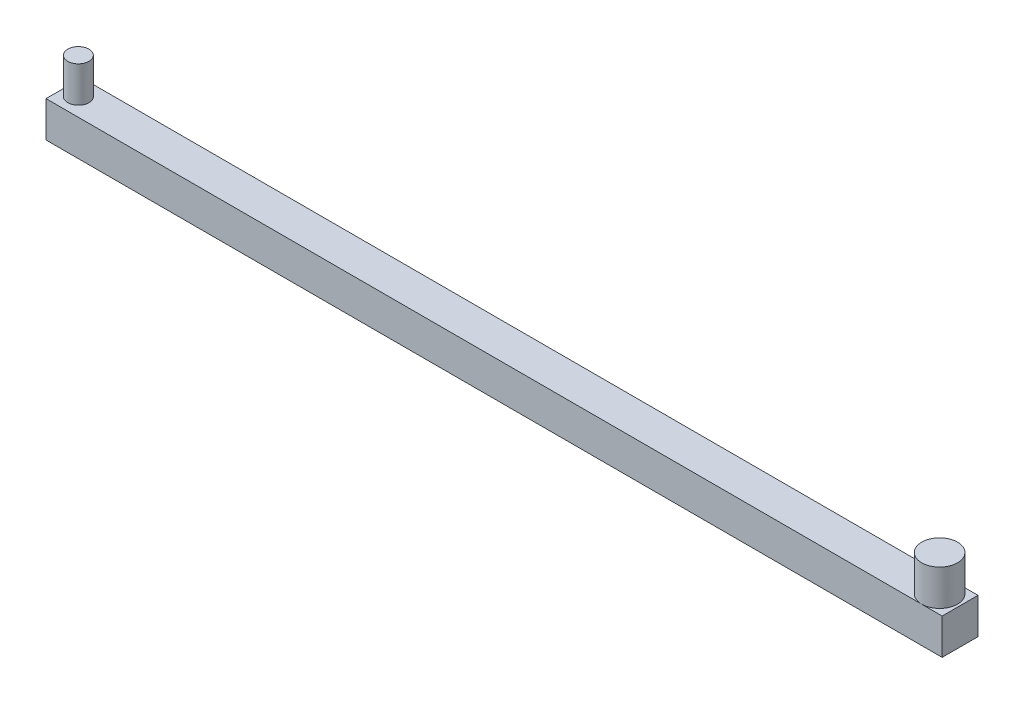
ISO-10303-21;
HEADER;
FILE_DESCRIPTION(('STEP AP214'),'2;1');
FILE_NAME('part.step','',(''),(''),'','','');
FILE_SCHEMA(('AUTOMOTIVE_DESIGN { 1 0 10303 214 1 1 1 1 }'));
ENDSEC;
DATA;
#1=APPLICATION_CONTEXT('core data for automotive mechanical design processes');
#2=APPLICATION_PROTOCOL_DEFINITION('international standard','automotive_design',2000,#1);
#3=PRODUCT_CONTEXT('',#1,'mechanical');
#4=PRODUCT('Part','Part','',(#3));
#5=PRODUCT_RELATED_PRODUCT_CATEGORY('part','',(#4));
#6=PRODUCT_DEFINITION_FORMATION('','',#4);
#7=PRODUCT_DEFINITION_CONTEXT('part definition',#1,'design');
#8=PRODUCT_DEFINITION('design','',#6,#7);
#9=PRODUCT_DEFINITION_SHAPE('','',#8);
#10=(LENGTH_UNIT() NAMED_UNIT(*) SI_UNIT(.MILLI.,.METRE.));
#11=(NAMED_UNIT(*) PLANE_ANGLE_UNIT() SI_UNIT($,.RADIAN.));
#12=(NAMED_UNIT(*) SI_UNIT($,.STERADIAN.) SOLID_ANGLE_UNIT());
#13=UNCERTAINTY_MEASURE_WITH_UNIT(LENGTH_MEASURE(1.E-05),#10,'distance_accuracy_value','');
#14=(GEOMETRIC_REPRESENTATION_CONTEXT(3) GLOBAL_UNCERTAINTY_ASSIGNED_CONTEXT((#13)) GLOBAL_UNIT_ASSIGNED_CONTEXT((#10,
#11,#12)) REPRESENTATION_CONTEXT('',''));
#15=CARTESIAN_POINT('',(0.,0.,0.));
#16=DIRECTION('',(0.,0.,1.));
#17=DIRECTION('',(1.,0.,0.));
#18=AXIS2_PLACEMENT_3D('',#15,#16,#17);
#19=CARTESIAN_POINT('',(0.,2.,0.));
#20=DIRECTION('',(0.,1.,0.));
#21=DIRECTION('',(0.,0.,1.));
#22=AXIS2_PLACEMENT_3D('',#19,#20,#21);
#23=PLANE('',#22);
#24=CARTESIAN_POINT('',(25.7805750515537,2.,-1.61133603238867));
#25=DIRECTION('',(0.,1.,0.));
#26=DIRECTION('',(0.,0.,1.));
#27=AXIS2_PLACEMENT_3D('',#24,#25,#26);
#28=CIRCLE('',#27,0.999999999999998);
#29=CARTESIAN_POINT('',(25.7805750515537,2.,-0.611336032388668));
#30=VERTEX_POINT('',#29);
#31=CARTESIAN_POINT('',(25.7805750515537,2.,-2.61133603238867));
#32=VERTEX_POINT('',#31);
#33=EDGE_CURVE('E120',#30,#32,#28,.T.);
#34=ORIENTED_EDGE('',*,*,#33,.F.);
#35=DIRECTION('',(1.,0.,0.));
#36=VECTOR('',#35,1.);
#37=CARTESIAN_POINT('',(-23.0769230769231,2.,-0.611336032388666));
#38=LINE('',#37,#36);
#39=CARTESIAN_POINT('',(26.9230769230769,2.,-0.611336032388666));
#40=VERTEX_POINT('',#39);
#41=EDGE_CURVE('E104',#30,#40,#38,.T.);
#42=ORIENTED_EDGE('',*,*,#41,.T.);
#43=DIRECTION('',(0.,0.,-1.));
#44=VECTOR('',#43,1.);
#45=CARTESIAN_POINT('',(26.9230769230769,2.,-2.61133603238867));
#46=LINE('',#45,#44);
#47=CARTESIAN_POINT('',(26.9230769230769,2.,-2.61133603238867));
#48=VERTEX_POINT('',#47);
#49=EDGE_CURVE('E102',#40,#48,#46,.T.);
#50=ORIENTED_EDGE('',*,*,#49,.T.);
#51=DIRECTION('',(-1.,0.,0.));
#52=VECTOR('',#51,1.);
#53=CARTESIAN_POINT('',(-23.0769230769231,2.,-2.61133603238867));
#54=LINE('',#53,#52);
#55=EDGE_CURVE('E116',#48,#32,#54,.T.);
#56=ORIENTED_EDGE('',*,*,#55,.T.);
#57=EDGE_LOOP('',(#34,#42,#50,#56));
#58=FACE_BOUND('',#57,.T.);
#59=ADVANCED_FACE('F44',(#58),#23,.T.);
#60=CARTESIAN_POINT('',(-23.0769230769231,2.,-2.61133603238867));
#61=DIRECTION('',(1.,0.,0.));
#62=DIRECTION('',(0.,0.,-1.));
#63=AXIS2_PLACEMENT_3D('',#60,#61,#62);
#64=PLANE('',#63);
#65=DIRECTION('',(0.,0.,1.));
#66=VECTOR('',#65,1.);
#67=CARTESIAN_POINT('',(-23.0769230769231,0.,-2.61133603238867));
#68=LINE('',#67,#66);
#69=CARTESIAN_POINT('',(-23.0769230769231,0.,-2.61133603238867));
#70=VERTEX_POINT('',#69);
#71=CARTESIAN_POINT('',(-23.0769230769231,0.,-0.611336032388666));
#72=VERTEX_POINT('',#71);
#73=EDGE_CURVE('E138',#70,#72,#68,.T.);
#74=ORIENTED_EDGE('',*,*,#73,.T.);
#75=DIRECTION('',(0.,-1.,0.));
#76=VECTOR('',#75,1.);
#77=CARTESIAN_POINT('',(-23.0769230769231,2.,-0.611336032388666));
#78=LINE('',#77,#76);
#79=CARTESIAN_POINT('',(-23.0769230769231,2.,-0.611336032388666));
#80=VERTEX_POINT('',#79);
#81=EDGE_CURVE('E47',#80,#72,#78,.T.);
#82=ORIENTED_EDGE('',*,*,#81,.F.);
#83=DIRECTION('',(0.,0.,1.));
#84=VECTOR('',#83,1.);
#85=CARTESIAN_POINT('',(-23.0769230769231,2.,-2.61133603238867));
#86=LINE('',#85,#84);
#87=CARTESIAN_POINT('',(-23.0769230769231,2.,-2.61133603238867));
#88=VERTEX_POINT('',#87);
#89=EDGE_CURVE('E101',#88,#80,#86,.T.);
#90=ORIENTED_EDGE('',*,*,#89,.F.);
#91=DIRECTION('',(0.,-1.,0.));
#92=VECTOR('',#91,1.);
#93=CARTESIAN_POINT('',(-23.0769230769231,2.,-2.61133603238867));
#94=LINE('',#93,#92);
#95=EDGE_CURVE('E136',#88,#70,#94,.T.);
#96=ORIENTED_EDGE('',*,*,#95,.T.);
#97=EDGE_LOOP('',(#74,#82,#90,#96));
#98=FACE_BOUND('',#97,.T.);
#99=ADVANCED_FACE('F50',(#98),#64,.F.);
#100=CARTESIAN_POINT('',(-23.0769230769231,2.,-0.611336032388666));
#101=DIRECTION('',(0.,0.,-1.));
#102=DIRECTION('',(-1.,0.,0.));
#103=AXIS2_PLACEMENT_3D('',#100,#101,#102);
#104=PLANE('',#103);
#105=DIRECTION('',(1.,0.,0.));
#106=VECTOR('',#105,1.);
#107=CARTESIAN_POINT('',(-23.0769230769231,0.,-0.611336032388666));
#108=LINE('',#107,#106);
#109=CARTESIAN_POINT('',(26.9230769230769,0.,-0.611336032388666));
#110=VERTEX_POINT('',#109);
#111=EDGE_CURVE('E145',#72,#110,#108,.T.);
#112=ORIENTED_EDGE('',*,*,#111,.T.);
#113=DIRECTION('',(0.,-1.,0.));
#114=VECTOR('',#113,1.);
#115=CARTESIAN_POINT('',(26.9230769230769,2.,-0.611336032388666));
#116=LINE('',#115,#114);
#117=EDGE_CURVE('E112',#40,#110,#116,.T.);
#118=ORIENTED_EDGE('',*,*,#117,.F.);
#119=ORIENTED_EDGE('',*,*,#41,.F.);
#120=EDGE_CURVE('E96',#80,#30,#38,.T.);
#121=ORIENTED_EDGE('',*,*,#120,.F.);
#122=ORIENTED_EDGE('',*,*,#81,.T.);
#123=EDGE_LOOP('',(#112,#118,#119,#121,#122));
#124=FACE_BOUND('',#123,.T.);
#125=ADVANCED_FACE('F108',(#124),#104,.F.);
#126=CARTESIAN_POINT('',(26.9230769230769,2.,-2.61133603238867));
#127=DIRECTION('',(-1.,0.,0.));
#128=DIRECTION('',(0.,0.,1.));
#129=AXIS2_PLACEMENT_3D('',#126,#127,#128);
#130=PLANE('',#129);
#131=DIRECTION('',(0.,0.,-1.));
#132=VECTOR('',#131,1.);
#133=CARTESIAN_POINT('',(26.9230769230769,0.,-2.61133603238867));
#134=LINE('',#133,#132);
#135=CARTESIAN_POINT('',(26.9230769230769,0.,-2.61133603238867));
#136=VERTEX_POINT('',#135);
#137=EDGE_CURVE('E150',#110,#136,#134,.T.);
#138=ORIENTED_EDGE('',*,*,#137,.T.);
#139=DIRECTION('',(0.,-1.,0.));
#140=VECTOR('',#139,1.);
#141=CARTESIAN_POINT('',(26.9230769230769,2.,-2.61133603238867));
#142=LINE('',#141,#140);
#143=EDGE_CURVE('E152',#48,#136,#142,.T.);
#144=ORIENTED_EDGE('',*,*,#143,.F.);
#145=ORIENTED_EDGE('',*,*,#49,.F.);
#146=ORIENTED_EDGE('',*,*,#117,.T.);
#147=EDGE_LOOP('',(#138,#144,#145,#146));
#148=FACE_BOUND('',#147,.T.);
#149=ADVANCED_FACE('F157',(#148),#130,.F.);
#150=CARTESIAN_POINT('',(-23.0769230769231,2.,-2.61133603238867));
#151=DIRECTION('',(0.,0.,1.));
#152=DIRECTION('',(1.,0.,0.));
#153=AXIS2_PLACEMENT_3D('',#150,#151,#152);
#154=PLANE('',#153);
#155=DIRECTION('',(-1.,0.,0.));
#156=VECTOR('',#155,1.);
#157=CARTESIAN_POINT('',(-23.0769230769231,0.,-2.61133603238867));
#158=LINE('',#157,#156);
#159=EDGE_CURVE('E90',#136,#70,#158,.T.);
#160=ORIENTED_EDGE('',*,*,#159,.T.);
#161=ORIENTED_EDGE('',*,*,#95,.F.);
#162=EDGE_CURVE('E69',#32,#88,#54,.T.);
#163=ORIENTED_EDGE('',*,*,#162,.F.);
#164=ORIENTED_EDGE('',*,*,#55,.F.);
#165=ORIENTED_EDGE('',*,*,#143,.T.);
#166=EDGE_LOOP('',(#160,#161,#163,#164,#165));
#167=FACE_BOUND('',#166,.T.);
#168=ADVANCED_FACE('F164',(#167),#154,.F.);
#169=CARTESIAN_POINT('',(-22.2694249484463,2.,-1.61133603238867));
#170=DIRECTION('',(0.,1.,0.));
#171=DIRECTION('',(0.,0.,1.));
#172=AXIS2_PLACEMENT_3D('',#169,#170,#171);
#173=CIRCLE('',#172,0.59);
#174=CARTESIAN_POINT('',(-22.2694249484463,2.,-1.02133603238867));
#175=VERTEX_POINT('',#174);
#176=EDGE_CURVE('E11',#175,#175,#173,.T.);
#177=ORIENTED_EDGE('',*,*,#176,.F.);
#178=EDGE_LOOP('',(#177));
#179=FACE_BOUND('',#178,.T.);
#180=EDGE_CURVE('E54',#32,#30,#28,.T.);
#181=ORIENTED_EDGE('',*,*,#180,.F.);
#182=ORIENTED_EDGE('',*,*,#162,.T.);
#183=ORIENTED_EDGE('',*,*,#89,.T.);
#184=ORIENTED_EDGE('',*,*,#120,.T.);
#185=EDGE_LOOP('',(#181,#182,#183,#184));
#186=FACE_BOUND('',#185,.T.);
#187=ADVANCED_FACE('F97',(#179,#186),#23,.T.);
#188=CARTESIAN_POINT('',(0.,0.,0.));
#189=DIRECTION('',(0.,1.,0.));
#190=DIRECTION('',(0.,0.,1.));
#191=AXIS2_PLACEMENT_3D('',#188,#189,#190);
#192=PLANE('',#191);
#193=ORIENTED_EDGE('',*,*,#73,.F.);
#194=ORIENTED_EDGE('',*,*,#159,.F.);
#195=ORIENTED_EDGE('',*,*,#137,.F.);
#196=ORIENTED_EDGE('',*,*,#111,.F.);
#197=EDGE_LOOP('',(#193,#194,#195,#196));
#198=FACE_BOUND('',#197,.T.);
#199=ADVANCED_FACE('F162',(#198),#192,.F.);
#200=CARTESIAN_POINT('',(25.7805750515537,4.,-1.61133603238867));
#201=DIRECTION('',(0.,-1.,0.));
#202=DIRECTION('',(0.,0.,-1.));
#203=AXIS2_PLACEMENT_3D('',#200,#201,#202);
#204=CYLINDRICAL_SURFACE('',#203,0.999999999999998);
#205=CARTESIAN_POINT('',(25.7805750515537,4.,-1.61133603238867));
#206=DIRECTION('',(0.,1.,0.));
#207=DIRECTION('',(0.,0.,1.));
#208=AXIS2_PLACEMENT_3D('',#205,#206,#207);
#209=CIRCLE('',#208,0.999999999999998);
#210=CARTESIAN_POINT('',(25.7805750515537,4.,-0.611336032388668));
#211=VERTEX_POINT('',#210);
#212=EDGE_CURVE('E125',#211,#211,#209,.T.);
#213=ORIENTED_EDGE('',*,*,#212,.F.);
#214=EDGE_LOOP('',(#213));
#215=FACE_BOUND('',#214,.T.);
#216=ORIENTED_EDGE('',*,*,#33,.T.);
#217=ORIENTED_EDGE('',*,*,#180,.T.);
#218=EDGE_LOOP('',(#216,#217));
#219=FACE_BOUND('',#218,.T.);
#220=ADVANCED_FACE('F123',(#215,#219),#204,.T.);
#221=CARTESIAN_POINT('',(25.7805750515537,4.,-1.61133603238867));
#222=DIRECTION('',(0.,1.,0.));
#223=DIRECTION('',(0.,0.,1.));
#224=AXIS2_PLACEMENT_3D('',#221,#222,#223);
#225=PLANE('',#224);
#226=ORIENTED_EDGE('',*,*,#212,.T.);
#227=EDGE_LOOP('',(#226));
#228=FACE_BOUND('',#227,.T.);
#229=ADVANCED_FACE('F177',(#228),#225,.T.);
#230=CARTESIAN_POINT('',(-22.2694249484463,4.,-1.61133603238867));
#231=DIRECTION('',(0.,-1.,0.));
#232=DIRECTION('',(0.,0.,-1.));
#233=AXIS2_PLACEMENT_3D('',#230,#231,#232);
#234=CYLINDRICAL_SURFACE('',#233,0.59);
#235=CARTESIAN_POINT('',(-22.2694249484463,4.,-1.61133603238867));
#236=DIRECTION('',(0.,1.,0.));
#237=DIRECTION('',(0.,0.,1.));
#238=AXIS2_PLACEMENT_3D('',#235,#236,#237);
#239=CIRCLE('',#238,0.59);
#240=CARTESIAN_POINT('',(-22.2694249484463,4.,-1.02133603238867));
#241=VERTEX_POINT('',#240);
#242=EDGE_CURVE('E124',#241,#241,#239,.T.);
#243=ORIENTED_EDGE('',*,*,#242,.F.);
#244=EDGE_LOOP('',(#243));
#245=FACE_BOUND('',#244,.T.);
#246=ORIENTED_EDGE('',*,*,#176,.T.);
#247=EDGE_LOOP('',(#246));
#248=FACE_BOUND('',#247,.T.);
#249=ADVANCED_FACE('F174',(#245,#248),#234,.T.);
#250=CARTESIAN_POINT('',(-22.2694249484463,4.,-1.61133603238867));
#251=DIRECTION('',(0.,1.,0.));
#252=DIRECTION('',(0.,0.,1.));
#253=AXIS2_PLACEMENT_3D('',#250,#251,#252);
#254=PLANE('',#253);
#255=ORIENTED_EDGE('',*,*,#242,.T.);
#256=EDGE_LOOP('',(#255));
#257=FACE_BOUND('',#256,.T.);
#258=ADVANCED_FACE('F172',(#257),#254,.T.);
#259=CLOSED_SHELL('',(#59,#99,#125,#149,#168,#187,#199,#220,#229,#249,#258));
#260=MANIFOLD_SOLID_BREP('B2',#259);
#261=ADVANCED_BREP_SHAPE_REPRESENTATION('',(#18,#260),#14);
#262=SHAPE_DEFINITION_REPRESENTATION(#9,#261);
ENDSEC;
END-ISO-10303-21;
